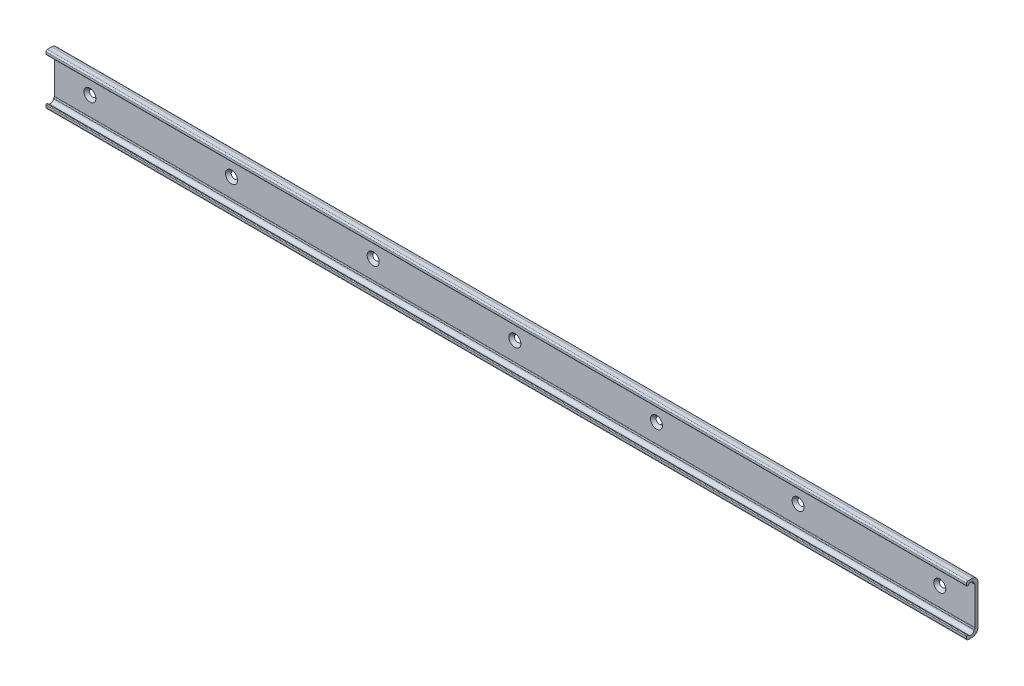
ISO-10303-21;
HEADER;
FILE_DESCRIPTION(('STEP AP214'),'2;1');
FILE_NAME('part.step','',(''),(''),'','','');
FILE_SCHEMA(('AUTOMOTIVE_DESIGN { 1 0 10303 214 1 1 1 1 }'));
ENDSEC;
DATA;
#1=APPLICATION_CONTEXT('core data for automotive mechanical design processes');
#2=APPLICATION_PROTOCOL_DEFINITION('international standard','automotive_design',2000,#1);
#3=PRODUCT_CONTEXT('',#1,'mechanical');
#4=PRODUCT('Part','Part','',(#3));
#5=PRODUCT_RELATED_PRODUCT_CATEGORY('part','',(#4));
#6=PRODUCT_DEFINITION_FORMATION('','',#4);
#7=PRODUCT_DEFINITION_CONTEXT('part definition',#1,'design');
#8=PRODUCT_DEFINITION('design','',#6,#7);
#9=PRODUCT_DEFINITION_SHAPE('','',#8);
#10=(LENGTH_UNIT() NAMED_UNIT(*) SI_UNIT(.MILLI.,.METRE.));
#11=(NAMED_UNIT(*) PLANE_ANGLE_UNIT() SI_UNIT($,.RADIAN.));
#12=(NAMED_UNIT(*) SI_UNIT($,.STERADIAN.) SOLID_ANGLE_UNIT());
#13=UNCERTAINTY_MEASURE_WITH_UNIT(LENGTH_MEASURE(1.E-05),#10,'distance_accuracy_value','');
#14=(GEOMETRIC_REPRESENTATION_CONTEXT(3) GLOBAL_UNCERTAINTY_ASSIGNED_CONTEXT((#13)) GLOBAL_UNIT_ASSIGNED_CONTEXT((#10,
#11,#12)) REPRESENTATION_CONTEXT('',''));
#15=CARTESIAN_POINT('',(0.,0.,0.));
#16=DIRECTION('',(0.,0.,1.));
#17=DIRECTION('',(1.,0.,0.));
#18=AXIS2_PLACEMENT_3D('',#15,#16,#17);
#19=CARTESIAN_POINT('',(625.,14.,4.));
#20=DIRECTION('',(-1.,0.,0.));
#21=DIRECTION('',(0.,0.,1.));
#22=AXIS2_PLACEMENT_3D('',#19,#20,#21);
#23=CYLINDRICAL_SURFACE('',#22,4.);
#24=CARTESIAN_POINT('',(-25.,14.,4.));
#25=DIRECTION('',(-1.,0.,0.));
#26=DIRECTION('',(0.,0.,1.));
#27=AXIS2_PLACEMENT_3D('',#24,#25,#26);
#28=CIRCLE('',#27,4.);
#29=CARTESIAN_POINT('',(-25.,18.,4.));
#30=VERTEX_POINT('',#29);
#31=CARTESIAN_POINT('',(-25.,14.,0.));
#32=VERTEX_POINT('',#31);
#33=EDGE_CURVE('E174',#30,#32,#28,.T.);
#34=ORIENTED_EDGE('',*,*,#33,.F.);
#35=DIRECTION('',(-1.,0.,0.));
#36=VECTOR('',#35,1.);
#37=CARTESIAN_POINT('',(625.,18.,4.));
#38=LINE('',#37,#36);
#39=CARTESIAN_POINT('',(625.,18.,4.));
#40=VERTEX_POINT('',#39);
#41=EDGE_CURVE('E9',#40,#30,#38,.T.);
#42=ORIENTED_EDGE('',*,*,#41,.F.);
#43=CARTESIAN_POINT('',(625.,14.,4.));
#44=DIRECTION('',(-1.,0.,0.));
#45=DIRECTION('',(0.,0.,1.));
#46=AXIS2_PLACEMENT_3D('',#43,#44,#45);
#47=CIRCLE('',#46,4.);
#48=CARTESIAN_POINT('',(625.,14.,0.));
#49=VERTEX_POINT('',#48);
#50=EDGE_CURVE('E176',#40,#49,#47,.T.);
#51=ORIENTED_EDGE('',*,*,#50,.T.);
#52=DIRECTION('',(-1.,0.,0.));
#53=VECTOR('',#52,1.);
#54=CARTESIAN_POINT('',(625.,14.,0.));
#55=LINE('',#54,#53);
#56=EDGE_CURVE('E17',#49,#32,#55,.T.);
#57=ORIENTED_EDGE('',*,*,#56,.T.);
#58=EDGE_LOOP('',(#34,#42,#51,#57));
#59=FACE_BOUND('',#58,.T.);
#60=ADVANCED_FACE('F14',(#59),#23,.T.);
#61=CARTESIAN_POINT('',(625.,18.,7.));
#62=DIRECTION('',(0.,1.,0.));
#63=DIRECTION('',(-1.,0.,0.));
#64=AXIS2_PLACEMENT_3D('',#61,#62,#63);
#65=PLANE('',#64);
#66=DIRECTION('',(0.,0.,-1.));
#67=VECTOR('',#66,1.);
#68=CARTESIAN_POINT('',(-25.,18.,7.));
#69=LINE('',#68,#67);
#70=CARTESIAN_POINT('',(-25.,18.,7.));
#71=VERTEX_POINT('',#70);
#72=EDGE_CURVE('E192',#71,#30,#69,.T.);
#73=ORIENTED_EDGE('',*,*,#72,.F.);
#74=DIRECTION('',(-1.,0.,0.));
#75=VECTOR('',#74,1.);
#76=CARTESIAN_POINT('',(625.,18.,7.));
#77=LINE('',#76,#75);
#78=CARTESIAN_POINT('',(625.,18.,7.));
#79=VERTEX_POINT('',#78);
#80=EDGE_CURVE('E22',#79,#71,#77,.T.);
#81=ORIENTED_EDGE('',*,*,#80,.F.);
#82=DIRECTION('',(0.,0.,-1.));
#83=VECTOR('',#82,1.);
#84=CARTESIAN_POINT('',(625.,18.,7.));
#85=LINE('',#84,#83);
#86=EDGE_CURVE('E181',#79,#40,#85,.T.);
#87=ORIENTED_EDGE('',*,*,#86,.T.);
#88=ORIENTED_EDGE('',*,*,#41,.T.);
#89=EDGE_LOOP('',(#73,#81,#87,#88));
#90=FACE_BOUND('',#89,.T.);
#91=ADVANCED_FACE('F448',(#90),#65,.T.);
#92=CARTESIAN_POINT('',(625.,17.,7.));
#93=DIRECTION('',(-1.,0.,0.));
#94=DIRECTION('',(0.,0.,1.));
#95=AXIS2_PLACEMENT_3D('',#92,#93,#94);
#96=CYLINDRICAL_SURFACE('',#95,1.);
#97=CARTESIAN_POINT('',(-25.,17.,7.));
#98=DIRECTION('',(-1.,0.,0.));
#99=DIRECTION('',(0.,0.,1.));
#100=AXIS2_PLACEMENT_3D('',#97,#98,#99);
#101=CIRCLE('',#100,1.);
#102=CARTESIAN_POINT('',(-25.,17.,8.));
#103=VERTEX_POINT('',#102);
#104=EDGE_CURVE('E258',#103,#71,#101,.T.);
#105=ORIENTED_EDGE('',*,*,#104,.F.);
#106=DIRECTION('',(-1.,0.,0.));
#107=VECTOR('',#106,1.);
#108=CARTESIAN_POINT('',(625.,17.,8.));
#109=LINE('',#108,#107);
#110=CARTESIAN_POINT('',(625.,17.,8.));
#111=VERTEX_POINT('',#110);
#112=EDGE_CURVE('E328',#111,#103,#109,.T.);
#113=ORIENTED_EDGE('',*,*,#112,.F.);
#114=CARTESIAN_POINT('',(625.,17.,7.));
#115=DIRECTION('',(-1.,0.,0.));
#116=DIRECTION('',(0.,0.,1.));
#117=AXIS2_PLACEMENT_3D('',#114,#115,#116);
#118=CIRCLE('',#117,1.);
#119=EDGE_CURVE('E324',#111,#79,#118,.T.);
#120=ORIENTED_EDGE('',*,*,#119,.T.);
#121=ORIENTED_EDGE('',*,*,#80,.T.);
#122=EDGE_LOOP('',(#105,#113,#120,#121));
#123=FACE_BOUND('',#122,.T.);
#124=ADVANCED_FACE('F453',(#123),#96,.T.);
#125=CARTESIAN_POINT('',(625.,15.55,8.));
#126=DIRECTION('',(0.,0.,1.));
#127=DIRECTION('',(1.,0.,0.));
#128=AXIS2_PLACEMENT_3D('',#125,#126,#127);
#129=PLANE('',#128);
#130=DIRECTION('',(0.,1.,0.));
#131=VECTOR('',#130,1.);
#132=CARTESIAN_POINT('',(-25.,15.55,8.));
#133=LINE('',#132,#131);
#134=CARTESIAN_POINT('',(-25.,15.55,8.));
#135=VERTEX_POINT('',#134);
#136=EDGE_CURVE('E255',#135,#103,#133,.T.);
#137=ORIENTED_EDGE('',*,*,#136,.F.);
#138=DIRECTION('',(-1.,0.,0.));
#139=VECTOR('',#138,1.);
#140=CARTESIAN_POINT('',(625.,15.55,8.));
#141=LINE('',#140,#139);
#142=CARTESIAN_POINT('',(625.,15.55,8.));
#143=VERTEX_POINT('',#142);
#144=EDGE_CURVE('E330',#143,#135,#141,.T.);
#145=ORIENTED_EDGE('',*,*,#144,.F.);
#146=DIRECTION('',(0.,1.,0.));
#147=VECTOR('',#146,1.);
#148=CARTESIAN_POINT('',(625.,15.55,8.));
#149=LINE('',#148,#147);
#150=EDGE_CURVE('E321',#143,#111,#149,.T.);
#151=ORIENTED_EDGE('',*,*,#150,.T.);
#152=ORIENTED_EDGE('',*,*,#112,.T.);
#153=EDGE_LOOP('',(#137,#145,#151,#152));
#154=FACE_BOUND('',#153,.T.);
#155=ADVANCED_FACE('F445',(#154),#129,.T.);
#156=CARTESIAN_POINT('',(625.,15.5499998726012,7.5));
#157=DIRECTION('',(-1.,0.,0.));
#158=DIRECTION('',(0.,0.,1.));
#159=AXIS2_PLACEMENT_3D('',#156,#157,#158);
#160=CYLINDRICAL_SURFACE('',#159,0.500000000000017);
#161=CARTESIAN_POINT('',(-25.,15.5499998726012,7.5));
#162=DIRECTION('',(-1.,0.,0.));
#163=DIRECTION('',(0.,0.,1.));
#164=AXIS2_PLACEMENT_3D('',#161,#162,#163);
#165=CIRCLE('',#164,0.500000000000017);
#166=CARTESIAN_POINT('',(-25.,15.0499998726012,7.49999995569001));
#167=VERTEX_POINT('',#166);
#168=EDGE_CURVE('E252',#167,#135,#165,.T.);
#169=ORIENTED_EDGE('',*,*,#168,.F.);
#170=DIRECTION('',(-1.,0.,0.));
#171=VECTOR('',#170,1.);
#172=CARTESIAN_POINT('',(625.,15.0499998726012,7.49999995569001));
#173=LINE('',#172,#171);
#174=CARTESIAN_POINT('',(625.,15.0499998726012,7.49999995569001));
#175=VERTEX_POINT('',#174);
#176=EDGE_CURVE('E332',#175,#167,#173,.T.);
#177=ORIENTED_EDGE('',*,*,#176,.F.);
#178=CARTESIAN_POINT('',(625.,15.5499998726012,7.5));
#179=DIRECTION('',(-1.,0.,0.));
#180=DIRECTION('',(0.,0.,1.));
#181=AXIS2_PLACEMENT_3D('',#178,#179,#180);
#182=CIRCLE('',#181,0.500000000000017);
#183=EDGE_CURVE('E318',#175,#143,#182,.T.);
#184=ORIENTED_EDGE('',*,*,#183,.T.);
#185=ORIENTED_EDGE('',*,*,#144,.T.);
#186=EDGE_LOOP('',(#169,#177,#184,#185));
#187=FACE_BOUND('',#186,.T.);
#188=ADVANCED_FACE('F441',(#187),#160,.T.);
#189=CARTESIAN_POINT('',(625.,15.0499998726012,7.49999995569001));
#190=DIRECTION('',(0.,-1.,0.));
#191=DIRECTION('',(1.,0.,0.));
#192=AXIS2_PLACEMENT_3D('',#189,#190,#191);
#193=PLANE('',#192);
#194=DIRECTION('',(0.,0.,1.));
#195=VECTOR('',#194,1.);
#196=CARTESIAN_POINT('',(-25.,15.0499998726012,7.49999995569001));
#197=LINE('',#196,#195);
#198=CARTESIAN_POINT('',(-25.,15.0499998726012,6.99185845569));
#199=VERTEX_POINT('',#198);
#200=EDGE_CURVE('E249',#199,#167,#197,.T.);
#201=ORIENTED_EDGE('',*,*,#200,.F.);
#202=DIRECTION('',(-1.,0.,0.));
#203=VECTOR('',#202,1.);
#204=CARTESIAN_POINT('',(625.,15.0499998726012,6.99185845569));
#205=LINE('',#204,#203);
#206=CARTESIAN_POINT('',(625.,15.0499998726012,6.99185845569));
#207=VERTEX_POINT('',#206);
#208=EDGE_CURVE('E334',#207,#199,#205,.T.);
#209=ORIENTED_EDGE('',*,*,#208,.F.);
#210=DIRECTION('',(0.,0.,1.));
#211=VECTOR('',#210,1.);
#212=CARTESIAN_POINT('',(625.,15.0499998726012,7.49999995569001));
#213=LINE('',#212,#211);
#214=EDGE_CURVE('E315',#207,#175,#213,.T.);
#215=ORIENTED_EDGE('',*,*,#214,.T.);
#216=ORIENTED_EDGE('',*,*,#176,.T.);
#217=EDGE_LOOP('',(#201,#209,#215,#216));
#218=FACE_BOUND('',#217,.T.);
#219=ADVANCED_FACE('F437',(#218),#193,.T.);
#220=CARTESIAN_POINT('',(625.,13.899999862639,4.99999993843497));
#221=DIRECTION('',(-1.,0.,0.));
#222=DIRECTION('',(0.,0.,1.));
#223=AXIS2_PLACEMENT_3D('',#220,#221,#222);
#224=CYLINDRICAL_SURFACE('',#223,2.30000008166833);
#225=CARTESIAN_POINT('',(-25.,13.899999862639,4.99999993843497));
#226=DIRECTION('',(1.,0.,0.));
#227=DIRECTION('',(0.,0.,1.));
#228=AXIS2_PLACEMENT_3D('',#225,#226,#227);
#229=CIRCLE('',#228,2.30000008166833);
#230=CARTESIAN_POINT('',(-25.,14.3822673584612,2.75112945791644));
#231=VERTEX_POINT('',#230);
#232=EDGE_CURVE('E246',#231,#199,#229,.T.);
#233=ORIENTED_EDGE('',*,*,#232,.F.);
#234=DIRECTION('',(-1.,0.,0.));
#235=VECTOR('',#234,1.);
#236=CARTESIAN_POINT('',(625.,14.3822673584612,2.75112945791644));
#237=LINE('',#236,#235);
#238=CARTESIAN_POINT('',(625.,14.3822673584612,2.75112945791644));
#239=VERTEX_POINT('',#238);
#240=EDGE_CURVE('E336',#239,#231,#237,.T.);
#241=ORIENTED_EDGE('',*,*,#240,.F.);
#242=CARTESIAN_POINT('',(625.,13.899999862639,4.99999993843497));
#243=DIRECTION('',(1.,0.,0.));
#244=DIRECTION('',(0.,0.,1.));
#245=AXIS2_PLACEMENT_3D('',#242,#243,#244);
#246=CIRCLE('',#245,2.30000008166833);
#247=EDGE_CURVE('E312',#239,#207,#246,.T.);
#248=ORIENTED_EDGE('',*,*,#247,.T.);
#249=ORIENTED_EDGE('',*,*,#208,.T.);
#250=EDGE_LOOP('',(#233,#241,#248,#249));
#251=FACE_BOUND('',#250,.T.);
#252=ADVANCED_FACE('F433',(#251),#224,.F.);
#253=CARTESIAN_POINT('',(625.,14.2647621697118,2.72240648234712));
#254=DIRECTION('',(0.,-0.237449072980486,0.971399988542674));
#255=DIRECTION('',(0.,0.971399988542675,0.237449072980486));
#256=AXIS2_PLACEMENT_3D('',#253,#254,#255);
#257=PLANE('',#256);
#258=DIRECTION('',(0.,0.971399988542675,0.237449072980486));
#259=VECTOR('',#258,1.);
#260=CARTESIAN_POINT('',(-25.,14.2647621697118,2.72240648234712));
#261=LINE('',#260,#259);
#262=CARTESIAN_POINT('',(-25.,14.2647621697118,2.72240648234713));
#263=VERTEX_POINT('',#262);
#264=EDGE_CURVE('E243',#263,#231,#261,.T.);
#265=ORIENTED_EDGE('',*,*,#264,.F.);
#266=DIRECTION('',(-1.,0.,0.));
#267=VECTOR('',#266,1.);
#268=CARTESIAN_POINT('',(625.,14.2647621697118,2.72240648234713));
#269=LINE('',#268,#267);
#270=CARTESIAN_POINT('',(625.,14.2647621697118,2.72240648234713));
#271=VERTEX_POINT('',#270);
#272=EDGE_CURVE('E338',#271,#263,#269,.T.);
#273=ORIENTED_EDGE('',*,*,#272,.F.);
#274=DIRECTION('',(0.,0.971399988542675,0.237449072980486));
#275=VECTOR('',#274,1.);
#276=CARTESIAN_POINT('',(625.,14.2647621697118,2.72240648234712));
#277=LINE('',#276,#275);
#278=EDGE_CURVE('E309',#271,#239,#277,.T.);
#279=ORIENTED_EDGE('',*,*,#278,.T.);
#280=ORIENTED_EDGE('',*,*,#240,.T.);
#281=EDGE_LOOP('',(#265,#273,#279,#280));
#282=FACE_BOUND('',#281,.T.);
#283=ADVANCED_FACE('F429',(#282),#257,.T.);
#284=CARTESIAN_POINT('',(625.,14.3343843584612,2.2272774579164));
#285=DIRECTION('',(-1.,0.,0.));
#286=DIRECTION('',(0.,0.,1.));
#287=AXIS2_PLACEMENT_3D('',#284,#285,#286);
#288=CYLINDRICAL_SURFACE('',#287,0.49999999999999);
#289=CARTESIAN_POINT('',(-25.,14.3343843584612,2.2272774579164));
#290=DIRECTION('',(-1.,0.,0.));
#291=DIRECTION('',(0.,0.,1.));
#292=AXIS2_PLACEMENT_3D('',#289,#290,#291);
#293=CIRCLE('',#292,0.49999999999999);
#294=CARTESIAN_POINT('',(-25.,13.980830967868,2.58083084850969));
#295=VERTEX_POINT('',#294);
#296=EDGE_CURVE('E240',#295,#263,#293,.T.);
#297=ORIENTED_EDGE('',*,*,#296,.F.);
#298=DIRECTION('',(-1.,0.,0.));
#299=VECTOR('',#298,1.);
#300=CARTESIAN_POINT('',(625.,13.980830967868,2.58083084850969));
#301=LINE('',#300,#299);
#302=CARTESIAN_POINT('',(625.,13.980830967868,2.58083084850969));
#303=VERTEX_POINT('',#302);
#304=EDGE_CURVE('E340',#303,#295,#301,.T.);
#305=ORIENTED_EDGE('',*,*,#304,.F.);
#306=CARTESIAN_POINT('',(625.,14.3343843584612,2.2272774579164));
#307=DIRECTION('',(-1.,0.,0.));
#308=DIRECTION('',(0.,0.,1.));
#309=AXIS2_PLACEMENT_3D('',#306,#307,#308);
#310=CIRCLE('',#309,0.49999999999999);
#311=EDGE_CURVE('E306',#303,#271,#310,.T.);
#312=ORIENTED_EDGE('',*,*,#311,.T.);
#313=ORIENTED_EDGE('',*,*,#272,.T.);
#314=EDGE_LOOP('',(#297,#305,#312,#313));
#315=FACE_BOUND('',#314,.T.);
#316=ADVANCED_FACE('F425',(#315),#288,.T.);
#317=CARTESIAN_POINT('',(625.,13.5464468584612,2.1464464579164));
#318=DIRECTION('',(0.,-0.707107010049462,0.707106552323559));
#319=DIRECTION('',(0.,0.707106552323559,0.707107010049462));
#320=AXIS2_PLACEMENT_3D('',#317,#318,#319);
#321=PLANE('',#320);
#322=DIRECTION('',(0.,0.707106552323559,0.707107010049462));
#323=VECTOR('',#322,1.);
#324=CARTESIAN_POINT('',(-25.,13.5464468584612,2.1464464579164));
#325=LINE('',#324,#323);
#326=CARTESIAN_POINT('',(-25.,13.5464468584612,2.1464464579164));
#327=VERTEX_POINT('',#326);
#328=EDGE_CURVE('E237',#327,#295,#325,.T.);
#329=ORIENTED_EDGE('',*,*,#328,.F.);
#330=DIRECTION('',(-1.,0.,0.));
#331=VECTOR('',#330,1.);
#332=CARTESIAN_POINT('',(625.,13.5464468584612,2.1464464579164));
#333=LINE('',#332,#331);
#334=CARTESIAN_POINT('',(625.,13.5464468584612,2.1464464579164));
#335=VERTEX_POINT('',#334);
#336=EDGE_CURVE('E342',#335,#327,#333,.T.);
#337=ORIENTED_EDGE('',*,*,#336,.F.);
#338=DIRECTION('',(0.,0.707106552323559,0.707107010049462));
#339=VECTOR('',#338,1.);
#340=CARTESIAN_POINT('',(625.,13.5464468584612,2.1464464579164));
#341=LINE('',#340,#339);
#342=EDGE_CURVE('E303',#335,#303,#341,.T.);
#343=ORIENTED_EDGE('',*,*,#342,.T.);
#344=ORIENTED_EDGE('',*,*,#304,.T.);
#345=EDGE_LOOP('',(#329,#337,#343,#344));
#346=FACE_BOUND('',#345,.T.);
#347=ADVANCED_FACE('F421',(#346),#321,.T.);
#348=CARTESIAN_POINT('',(625.,13.1928934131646,2.49999990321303));
#349=DIRECTION('',(-1.,0.,0.));
#350=DIRECTION('',(0.,0.,1.));
#351=AXIS2_PLACEMENT_3D('',#348,#349,#350);
#352=CYLINDRICAL_SURFACE('',#351,0.500000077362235);
#353=CARTESIAN_POINT('',(-25.,13.1928934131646,2.49999990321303));
#354=DIRECTION('',(1.,0.,0.));
#355=DIRECTION('',(0.,0.,1.));
#356=AXIS2_PLACEMENT_3D('',#353,#354,#355);
#357=CIRCLE('',#356,0.500000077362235);
#358=CARTESIAN_POINT('',(-25.,13.1928934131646,1.9999998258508));
#359=VERTEX_POINT('',#358);
#360=EDGE_CURVE('E234',#359,#327,#357,.T.);
#361=ORIENTED_EDGE('',*,*,#360,.F.);
#362=DIRECTION('',(-1.,0.,0.));
#363=VECTOR('',#362,1.);
#364=CARTESIAN_POINT('',(625.,13.1928934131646,1.9999998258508));
#365=LINE('',#364,#363);
#366=CARTESIAN_POINT('',(625.,13.1928934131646,1.9999998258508));
#367=VERTEX_POINT('',#366);
#368=EDGE_CURVE('E344',#367,#359,#365,.T.);
#369=ORIENTED_EDGE('',*,*,#368,.F.);
#370=CARTESIAN_POINT('',(625.,13.1928934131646,2.49999990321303));
#371=DIRECTION('',(1.,0.,0.));
#372=DIRECTION('',(0.,0.,1.));
#373=AXIS2_PLACEMENT_3D('',#370,#371,#372);
#374=CIRCLE('',#373,0.500000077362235);
#375=EDGE_CURVE('E300',#367,#335,#374,.T.);
#376=ORIENTED_EDGE('',*,*,#375,.T.);
#377=ORIENTED_EDGE('',*,*,#336,.T.);
#378=EDGE_LOOP('',(#361,#369,#376,#377));
#379=FACE_BOUND('',#378,.T.);
#380=ADVANCED_FACE('F417',(#379),#352,.F.);
#381=CARTESIAN_POINT('',(625.,-13.1928934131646,1.9999998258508));
#382=DIRECTION('',(0.,0.,1.));
#383=DIRECTION('',(0.,1.,0.));
#384=AXIS2_PLACEMENT_3D('',#381,#382,#383);
#385=PLANE('',#384);
#386=CARTESIAN_POINT('',(600.,0.,1.9999998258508));
#387=DIRECTION('',(0.,0.,1.));
#388=DIRECTION('',(0.,1.,0.));
#389=AXIS2_PLACEMENT_3D('',#386,#387,#388);
#390=CIRCLE('',#389,4.25);
#391=CARTESIAN_POINT('',(600.,4.25,1.99999982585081));
#392=VERTEX_POINT('',#391);
#393=EDGE_CURVE('E742',#392,#392,#390,.T.);
#394=ORIENTED_EDGE('',*,*,#393,.F.);
#395=EDGE_LOOP('',(#394));
#396=FACE_BOUND('',#395,.T.);
#397=CARTESIAN_POINT('',(500.,0.,1.9999998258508));
#398=DIRECTION('',(0.,0.,1.));
#399=DIRECTION('',(0.,1.,0.));
#400=AXIS2_PLACEMENT_3D('',#397,#398,#399);
#401=CIRCLE('',#400,4.25);
#402=CARTESIAN_POINT('',(500.,4.25,1.99999982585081));
#403=VERTEX_POINT('',#402);
#404=EDGE_CURVE('E746',#403,#403,#401,.T.);
#405=ORIENTED_EDGE('',*,*,#404,.F.);
#406=EDGE_LOOP('',(#405));
#407=FACE_BOUND('',#406,.T.);
#408=CARTESIAN_POINT('',(400.,0.,1.9999998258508));
#409=DIRECTION('',(0.,0.,1.));
#410=DIRECTION('',(0.,1.,0.));
#411=AXIS2_PLACEMENT_3D('',#408,#409,#410);
#412=CIRCLE('',#411,4.25);
#413=CARTESIAN_POINT('',(400.,4.25,1.99999982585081));
#414=VERTEX_POINT('',#413);
#415=EDGE_CURVE('E755',#414,#414,#412,.T.);
#416=ORIENTED_EDGE('',*,*,#415,.F.);
#417=EDGE_LOOP('',(#416));
#418=FACE_BOUND('',#417,.T.);
#419=CARTESIAN_POINT('',(300.,0.,1.9999998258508));
#420=DIRECTION('',(0.,0.,1.));
#421=DIRECTION('',(0.,1.,0.));
#422=AXIS2_PLACEMENT_3D('',#419,#420,#421);
#423=CIRCLE('',#422,4.25);
#424=CARTESIAN_POINT('',(300.,4.25,1.99999982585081));
#425=VERTEX_POINT('',#424);
#426=EDGE_CURVE('E761',#425,#425,#423,.T.);
#427=ORIENTED_EDGE('',*,*,#426,.F.);
#428=EDGE_LOOP('',(#427));
#429=FACE_BOUND('',#428,.T.);
#430=CARTESIAN_POINT('',(200.,0.,1.9999998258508));
#431=DIRECTION('',(0.,0.,1.));
#432=DIRECTION('',(0.,1.,0.));
#433=AXIS2_PLACEMENT_3D('',#430,#431,#432);
#434=CIRCLE('',#433,4.25);
#435=CARTESIAN_POINT('',(200.,4.25,1.99999982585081));
#436=VERTEX_POINT('',#435);
#437=EDGE_CURVE('E767',#436,#436,#434,.T.);
#438=ORIENTED_EDGE('',*,*,#437,.F.);
#439=EDGE_LOOP('',(#438));
#440=FACE_BOUND('',#439,.T.);
#441=CARTESIAN_POINT('',(100.,0.,1.9999998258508));
#442=DIRECTION('',(0.,0.,1.));
#443=DIRECTION('',(0.,1.,0.));
#444=AXIS2_PLACEMENT_3D('',#441,#442,#443);
#445=CIRCLE('',#444,4.25);
#446=CARTESIAN_POINT('',(100.,4.25,1.99999982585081));
#447=VERTEX_POINT('',#446);
#448=EDGE_CURVE('E773',#447,#447,#445,.T.);
#449=ORIENTED_EDGE('',*,*,#448,.F.);
#450=EDGE_LOOP('',(#449));
#451=FACE_BOUND('',#450,.T.);
#452=CARTESIAN_POINT('',(0.,0.,1.9999998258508));
#453=DIRECTION('',(0.,0.,1.));
#454=DIRECTION('',(0.,1.,0.));
#455=AXIS2_PLACEMENT_3D('',#452,#453,#454);
#456=CIRCLE('',#455,4.25);
#457=CARTESIAN_POINT('',(0.,4.25,1.99999982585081));
#458=VERTEX_POINT('',#457);
#459=EDGE_CURVE('E196',#458,#458,#456,.T.);
#460=ORIENTED_EDGE('',*,*,#459,.F.);
#461=EDGE_LOOP('',(#460));
#462=FACE_BOUND('',#461,.T.);
#463=DIRECTION('',(0.,1.,0.));
#464=VECTOR('',#463,1.);
#465=CARTESIAN_POINT('',(-25.,-13.1928934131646,1.9999998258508));
#466=LINE('',#465,#464);
#467=CARTESIAN_POINT('',(-25.,-13.1928934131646,1.9999998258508));
#468=VERTEX_POINT('',#467);
#469=EDGE_CURVE('E231',#468,#359,#466,.T.);
#470=ORIENTED_EDGE('',*,*,#469,.F.);
#471=DIRECTION('',(-1.,0.,0.));
#472=VECTOR('',#471,1.);
#473=CARTESIAN_POINT('',(625.,-13.1928934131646,1.9999998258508));
#474=LINE('',#473,#472);
#475=CARTESIAN_POINT('',(625.,-13.1928934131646,1.9999998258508));
#476=VERTEX_POINT('',#475);
#477=EDGE_CURVE('E346',#476,#468,#474,.T.);
#478=ORIENTED_EDGE('',*,*,#477,.F.);
#479=DIRECTION('',(0.,1.,0.));
#480=VECTOR('',#479,1.);
#481=CARTESIAN_POINT('',(625.,-13.1928934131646,1.9999998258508));
#482=LINE('',#481,#480);
#483=EDGE_CURVE('E297',#476,#367,#482,.T.);
#484=ORIENTED_EDGE('',*,*,#483,.T.);
#485=ORIENTED_EDGE('',*,*,#368,.T.);
#486=EDGE_LOOP('',(#470,#478,#484,#485));
#487=FACE_BOUND('',#486,.T.);
#488=ADVANCED_FACE('F413',(#396,#407,#418,#429,#440,#451,#462,#487),#385,.T.);
#489=CARTESIAN_POINT('',(625.,-13.1928934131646,2.49999990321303));
#490=DIRECTION('',(-1.,0.,0.));
#491=DIRECTION('',(0.,0.,1.));
#492=AXIS2_PLACEMENT_3D('',#489,#490,#491);
#493=CYLINDRICAL_SURFACE('',#492,0.500000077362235);
#494=CARTESIAN_POINT('',(-25.,-13.1928934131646,2.49999990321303));
#495=DIRECTION('',(1.,0.,0.));
#496=DIRECTION('',(0.,0.,-1.));
#497=AXIS2_PLACEMENT_3D('',#494,#495,#496);
#498=CIRCLE('',#497,0.500000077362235);
#499=CARTESIAN_POINT('',(-25.,-13.5464468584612,2.1464464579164));
#500=VERTEX_POINT('',#499);
#501=EDGE_CURVE('E228',#500,#468,#498,.T.);
#502=ORIENTED_EDGE('',*,*,#501,.F.);
#503=DIRECTION('',(-1.,0.,0.));
#504=VECTOR('',#503,1.);
#505=CARTESIAN_POINT('',(625.,-13.5464468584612,2.1464464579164));
#506=LINE('',#505,#504);
#507=CARTESIAN_POINT('',(625.,-13.5464468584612,2.1464464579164));
#508=VERTEX_POINT('',#507);
#509=EDGE_CURVE('E348',#508,#500,#506,.T.);
#510=ORIENTED_EDGE('',*,*,#509,.F.);
#511=CARTESIAN_POINT('',(625.,-13.1928934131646,2.49999990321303));
#512=DIRECTION('',(1.,0.,0.));
#513=DIRECTION('',(0.,0.,-1.));
#514=AXIS2_PLACEMENT_3D('',#511,#512,#513);
#515=CIRCLE('',#514,0.500000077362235);
#516=EDGE_CURVE('E294',#508,#476,#515,.T.);
#517=ORIENTED_EDGE('',*,*,#516,.T.);
#518=ORIENTED_EDGE('',*,*,#477,.T.);
#519=EDGE_LOOP('',(#502,#510,#517,#518));
#520=FACE_BOUND('',#519,.T.);
#521=ADVANCED_FACE('F409',(#520),#493,.F.);
#522=CARTESIAN_POINT('',(625.,-13.5464468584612,2.1464464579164));
#523=DIRECTION('',(0.,0.707107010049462,0.707106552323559));
#524=DIRECTION('',(0.,0.707106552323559,-0.707107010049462));
#525=AXIS2_PLACEMENT_3D('',#522,#523,#524);
#526=PLANE('',#525);
#527=DIRECTION('',(0.,0.707106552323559,-0.707107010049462));
#528=VECTOR('',#527,1.);
#529=CARTESIAN_POINT('',(-25.,-13.5464468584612,2.1464464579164));
#530=LINE('',#529,#528);
#531=CARTESIAN_POINT('',(-25.,-13.980830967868,2.58083084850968));
#532=VERTEX_POINT('',#531);
#533=EDGE_CURVE('E225',#532,#500,#530,.T.);
#534=ORIENTED_EDGE('',*,*,#533,.F.);
#535=DIRECTION('',(-1.,0.,0.));
#536=VECTOR('',#535,1.);
#537=CARTESIAN_POINT('',(625.,-13.980830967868,2.58083084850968));
#538=LINE('',#537,#536);
#539=CARTESIAN_POINT('',(625.,-13.980830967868,2.58083084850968));
#540=VERTEX_POINT('',#539);
#541=EDGE_CURVE('E350',#540,#532,#538,.T.);
#542=ORIENTED_EDGE('',*,*,#541,.F.);
#543=DIRECTION('',(0.,0.707106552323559,-0.707107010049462));
#544=VECTOR('',#543,1.);
#545=CARTESIAN_POINT('',(625.,-13.5464468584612,2.1464464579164));
#546=LINE('',#545,#544);
#547=EDGE_CURVE('E291',#540,#508,#546,.T.);
#548=ORIENTED_EDGE('',*,*,#547,.T.);
#549=ORIENTED_EDGE('',*,*,#509,.T.);
#550=EDGE_LOOP('',(#534,#542,#548,#549));
#551=FACE_BOUND('',#550,.T.);
#552=ADVANCED_FACE('F405',(#551),#526,.T.);
#553=CARTESIAN_POINT('',(625.,-14.3343843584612,2.22727745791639));
#554=DIRECTION('',(-1.,0.,0.));
#555=DIRECTION('',(0.,0.,1.));
#556=AXIS2_PLACEMENT_3D('',#553,#554,#555);
#557=CYLINDRICAL_SURFACE('',#556,0.49999999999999);
#558=CARTESIAN_POINT('',(-25.,-14.3343843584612,2.22727745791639));
#559=DIRECTION('',(-1.,0.,0.));
#560=DIRECTION('',(0.,0.,-1.));
#561=AXIS2_PLACEMENT_3D('',#558,#559,#560);
#562=CIRCLE('',#561,0.49999999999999);
#563=CARTESIAN_POINT('',(-25.,-14.2647621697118,2.72240648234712));
#564=VERTEX_POINT('',#563);
#565=EDGE_CURVE('E222',#564,#532,#562,.T.);
#566=ORIENTED_EDGE('',*,*,#565,.F.);
#567=DIRECTION('',(-1.,0.,0.));
#568=VECTOR('',#567,1.);
#569=CARTESIAN_POINT('',(625.,-14.2647621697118,2.72240648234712));
#570=LINE('',#569,#568);
#571=CARTESIAN_POINT('',(625.,-14.2647621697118,2.72240648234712));
#572=VERTEX_POINT('',#571);
#573=EDGE_CURVE('E352',#572,#564,#570,.T.);
#574=ORIENTED_EDGE('',*,*,#573,.F.);
#575=CARTESIAN_POINT('',(625.,-14.3343843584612,2.22727745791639));
#576=DIRECTION('',(-1.,0.,0.));
#577=DIRECTION('',(0.,0.,-1.));
#578=AXIS2_PLACEMENT_3D('',#575,#576,#577);
#579=CIRCLE('',#578,0.49999999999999);
#580=EDGE_CURVE('E288',#572,#540,#579,.T.);
#581=ORIENTED_EDGE('',*,*,#580,.T.);
#582=ORIENTED_EDGE('',*,*,#541,.T.);
#583=EDGE_LOOP('',(#566,#574,#581,#582));
#584=FACE_BOUND('',#583,.T.);
#585=ADVANCED_FACE('F401',(#584),#557,.T.);
#586=CARTESIAN_POINT('',(625.,-14.2647621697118,2.72240648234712));
#587=DIRECTION('',(0.,0.237449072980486,0.971399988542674));
#588=DIRECTION('',(0.,0.971399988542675,-0.237449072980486));
#589=AXIS2_PLACEMENT_3D('',#586,#587,#588);
#590=PLANE('',#589);
#591=DIRECTION('',(0.,0.971399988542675,-0.237449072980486));
#592=VECTOR('',#591,1.);
#593=CARTESIAN_POINT('',(-25.,-14.2647621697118,2.72240648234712));
#594=LINE('',#593,#592);
#595=CARTESIAN_POINT('',(-25.,-14.3822673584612,2.75112945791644));
#596=VERTEX_POINT('',#595);
#597=EDGE_CURVE('E219',#596,#564,#594,.T.);
#598=ORIENTED_EDGE('',*,*,#597,.F.);
#599=DIRECTION('',(-1.,0.,0.));
#600=VECTOR('',#599,1.);
#601=CARTESIAN_POINT('',(625.,-14.3822673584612,2.75112945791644));
#602=LINE('',#601,#600);
#603=CARTESIAN_POINT('',(625.,-14.3822673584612,2.75112945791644));
#604=VERTEX_POINT('',#603);
#605=EDGE_CURVE('E354',#604,#596,#602,.T.);
#606=ORIENTED_EDGE('',*,*,#605,.F.);
#607=DIRECTION('',(0.,0.971399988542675,-0.237449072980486));
#608=VECTOR('',#607,1.);
#609=CARTESIAN_POINT('',(625.,-14.2647621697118,2.72240648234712));
#610=LINE('',#609,#608);
#611=EDGE_CURVE('E285',#604,#572,#610,.T.);
#612=ORIENTED_EDGE('',*,*,#611,.T.);
#613=ORIENTED_EDGE('',*,*,#573,.T.);
#614=EDGE_LOOP('',(#598,#606,#612,#613));
#615=FACE_BOUND('',#614,.T.);
#616=ADVANCED_FACE('F397',(#615),#590,.T.);
#617=CARTESIAN_POINT('',(625.,-13.899999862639,4.99999993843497));
#618=DIRECTION('',(-1.,0.,0.));
#619=DIRECTION('',(0.,0.,1.));
#620=AXIS2_PLACEMENT_3D('',#617,#618,#619);
#621=CYLINDRICAL_SURFACE('',#620,2.30000008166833);
#622=CARTESIAN_POINT('',(-25.,-13.899999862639,4.99999993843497));
#623=DIRECTION('',(1.,0.,0.));
#624=DIRECTION('',(0.,0.,-1.));
#625=AXIS2_PLACEMENT_3D('',#622,#623,#624);
#626=CIRCLE('',#625,2.30000008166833);
#627=CARTESIAN_POINT('',(-25.,-15.0499998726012,6.99185845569));
#628=VERTEX_POINT('',#627);
#629=EDGE_CURVE('E216',#628,#596,#626,.T.);
#630=ORIENTED_EDGE('',*,*,#629,.F.);
#631=DIRECTION('',(-1.,0.,0.));
#632=VECTOR('',#631,1.);
#633=CARTESIAN_POINT('',(625.,-15.0499998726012,6.99185845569));
#634=LINE('',#633,#632);
#635=CARTESIAN_POINT('',(625.,-15.0499998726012,6.99185845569));
#636=VERTEX_POINT('',#635);
#637=EDGE_CURVE('E356',#636,#628,#634,.T.);
#638=ORIENTED_EDGE('',*,*,#637,.F.);
#639=CARTESIAN_POINT('',(625.,-13.899999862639,4.99999993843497));
#640=DIRECTION('',(1.,0.,0.));
#641=DIRECTION('',(0.,0.,-1.));
#642=AXIS2_PLACEMENT_3D('',#639,#640,#641);
#643=CIRCLE('',#642,2.30000008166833);
#644=EDGE_CURVE('E282',#636,#604,#643,.T.);
#645=ORIENTED_EDGE('',*,*,#644,.T.);
#646=ORIENTED_EDGE('',*,*,#605,.T.);
#647=EDGE_LOOP('',(#630,#638,#645,#646));
#648=FACE_BOUND('',#647,.T.);
#649=ADVANCED_FACE('F393',(#648),#621,.F.);
#650=CARTESIAN_POINT('',(625.,-15.0499998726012,7.49999995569));
#651=DIRECTION('',(0.,1.,0.));
#652=DIRECTION('',(-1.,0.,0.));
#653=AXIS2_PLACEMENT_3D('',#650,#651,#652);
#654=PLANE('',#653);
#655=DIRECTION('',(0.,0.,-1.));
#656=VECTOR('',#655,1.);
#657=CARTESIAN_POINT('',(-25.,-15.0499998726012,7.49999995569));
#658=LINE('',#657,#656);
#659=CARTESIAN_POINT('',(-25.,-15.0499998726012,7.49999995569));
#660=VERTEX_POINT('',#659);
#661=EDGE_CURVE('E213',#660,#628,#658,.T.);
#662=ORIENTED_EDGE('',*,*,#661,.F.);
#663=DIRECTION('',(-1.,0.,0.));
#664=VECTOR('',#663,1.);
#665=CARTESIAN_POINT('',(625.,-15.0499998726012,7.49999995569));
#666=LINE('',#665,#664);
#667=CARTESIAN_POINT('',(625.,-15.0499998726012,7.49999995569));
#668=VERTEX_POINT('',#667);
#669=EDGE_CURVE('E358',#668,#660,#666,.T.);
#670=ORIENTED_EDGE('',*,*,#669,.F.);
#671=DIRECTION('',(0.,0.,-1.));
#672=VECTOR('',#671,1.);
#673=CARTESIAN_POINT('',(625.,-15.0499998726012,7.49999995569));
#674=LINE('',#673,#672);
#675=EDGE_CURVE('E279',#668,#636,#674,.T.);
#676=ORIENTED_EDGE('',*,*,#675,.T.);
#677=ORIENTED_EDGE('',*,*,#637,.T.);
#678=EDGE_LOOP('',(#662,#670,#676,#677));
#679=FACE_BOUND('',#678,.T.);
#680=ADVANCED_FACE('F389',(#679),#654,.T.);
#681=CARTESIAN_POINT('',(625.,-15.5499998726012,7.5));
#682=DIRECTION('',(-1.,0.,0.));
#683=DIRECTION('',(0.,0.,1.));
#684=AXIS2_PLACEMENT_3D('',#681,#682,#683);
#685=CYLINDRICAL_SURFACE('',#684,0.500000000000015);
#686=CARTESIAN_POINT('',(-25.,-15.5499998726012,7.5));
#687=DIRECTION('',(-1.,0.,0.));
#688=DIRECTION('',(0.,0.,-1.));
#689=AXIS2_PLACEMENT_3D('',#686,#687,#688);
#690=CIRCLE('',#689,0.500000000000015);
#691=CARTESIAN_POINT('',(-25.,-15.55,8.));
#692=VERTEX_POINT('',#691);
#693=EDGE_CURVE('E210',#692,#660,#690,.T.);
#694=ORIENTED_EDGE('',*,*,#693,.F.);
#695=DIRECTION('',(-1.,0.,0.));
#696=VECTOR('',#695,1.);
#697=CARTESIAN_POINT('',(625.,-15.55,8.));
#698=LINE('',#697,#696);
#699=CARTESIAN_POINT('',(625.,-15.55,8.));
#700=VERTEX_POINT('',#699);
#701=EDGE_CURVE('E360',#700,#692,#698,.T.);
#702=ORIENTED_EDGE('',*,*,#701,.F.);
#703=CARTESIAN_POINT('',(625.,-15.5499998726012,7.5));
#704=DIRECTION('',(-1.,0.,0.));
#705=DIRECTION('',(0.,0.,-1.));
#706=AXIS2_PLACEMENT_3D('',#703,#704,#705);
#707=CIRCLE('',#706,0.500000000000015);
#708=EDGE_CURVE('E276',#700,#668,#707,.T.);
#709=ORIENTED_EDGE('',*,*,#708,.T.);
#710=ORIENTED_EDGE('',*,*,#669,.T.);
#711=EDGE_LOOP('',(#694,#702,#709,#710));
#712=FACE_BOUND('',#711,.T.);
#713=ADVANCED_FACE('F385',(#712),#685,.T.);
#714=CARTESIAN_POINT('',(625.,-15.55,8.));
#715=DIRECTION('',(0.,0.,1.));
#716=DIRECTION('',(1.,0.,0.));
#717=AXIS2_PLACEMENT_3D('',#714,#715,#716);
#718=PLANE('',#717);
#719=DIRECTION('',(0.,1.,0.));
#720=VECTOR('',#719,1.);
#721=CARTESIAN_POINT('',(-25.,-15.55,8.));
#722=LINE('',#721,#720);
#723=CARTESIAN_POINT('',(-25.,-17.,8.));
#724=VERTEX_POINT('',#723);
#725=EDGE_CURVE('E207',#724,#692,#722,.T.);
#726=ORIENTED_EDGE('',*,*,#725,.F.);
#727=DIRECTION('',(-1.,0.,0.));
#728=VECTOR('',#727,1.);
#729=CARTESIAN_POINT('',(625.,-17.,8.));
#730=LINE('',#729,#728);
#731=CARTESIAN_POINT('',(625.,-17.,8.));
#732=VERTEX_POINT('',#731);
#733=EDGE_CURVE('E362',#732,#724,#730,.T.);
#734=ORIENTED_EDGE('',*,*,#733,.F.);
#735=DIRECTION('',(0.,1.,0.));
#736=VECTOR('',#735,1.);
#737=CARTESIAN_POINT('',(625.,-15.55,8.));
#738=LINE('',#737,#736);
#739=EDGE_CURVE('E273',#732,#700,#738,.T.);
#740=ORIENTED_EDGE('',*,*,#739,.T.);
#741=ORIENTED_EDGE('',*,*,#701,.T.);
#742=EDGE_LOOP('',(#726,#734,#740,#741));
#743=FACE_BOUND('',#742,.T.);
#744=ADVANCED_FACE('F381',(#743),#718,.T.);
#745=CARTESIAN_POINT('',(625.,-17.,7.));
#746=DIRECTION('',(-1.,0.,0.));
#747=DIRECTION('',(0.,0.,1.));
#748=AXIS2_PLACEMENT_3D('',#745,#746,#747);
#749=CYLINDRICAL_SURFACE('',#748,1.);
#750=CARTESIAN_POINT('',(-25.,-17.,7.));
#751=DIRECTION('',(-1.,0.,0.));
#752=DIRECTION('',(0.,0.,-1.));
#753=AXIS2_PLACEMENT_3D('',#750,#751,#752);
#754=CIRCLE('',#753,1.);
#755=CARTESIAN_POINT('',(-25.,-18.,7.));
#756=VERTEX_POINT('',#755);
#757=EDGE_CURVE('E204',#756,#724,#754,.T.);
#758=ORIENTED_EDGE('',*,*,#757,.F.);
#759=DIRECTION('',(-1.,0.,0.));
#760=VECTOR('',#759,1.);
#761=CARTESIAN_POINT('',(625.,-18.,7.));
#762=LINE('',#761,#760);
#763=CARTESIAN_POINT('',(625.,-18.,7.));
#764=VERTEX_POINT('',#763);
#765=EDGE_CURVE('E364',#764,#756,#762,.T.);
#766=ORIENTED_EDGE('',*,*,#765,.F.);
#767=CARTESIAN_POINT('',(625.,-17.,7.));
#768=DIRECTION('',(-1.,0.,0.));
#769=DIRECTION('',(0.,0.,-1.));
#770=AXIS2_PLACEMENT_3D('',#767,#768,#769);
#771=CIRCLE('',#770,1.);
#772=EDGE_CURVE('E270',#764,#732,#771,.T.);
#773=ORIENTED_EDGE('',*,*,#772,.T.);
#774=ORIENTED_EDGE('',*,*,#733,.T.);
#775=EDGE_LOOP('',(#758,#766,#773,#774));
#776=FACE_BOUND('',#775,.T.);
#777=ADVANCED_FACE('F377',(#776),#749,.T.);
#778=CARTESIAN_POINT('',(625.,-18.,7.));
#779=DIRECTION('',(0.,-1.,0.));
#780=DIRECTION('',(1.,0.,0.));
#781=AXIS2_PLACEMENT_3D('',#778,#779,#780);
#782=PLANE('',#781);
#783=DIRECTION('',(0.,0.,1.));
#784=VECTOR('',#783,1.);
#785=CARTESIAN_POINT('',(-25.,-18.,7.));
#786=LINE('',#785,#784);
#787=CARTESIAN_POINT('',(-25.,-18.,4.));
#788=VERTEX_POINT('',#787);
#789=EDGE_CURVE('E201',#788,#756,#786,.T.);
#790=ORIENTED_EDGE('',*,*,#789,.F.);
#791=DIRECTION('',(-1.,0.,0.));
#792=VECTOR('',#791,1.);
#793=CARTESIAN_POINT('',(625.,-18.,4.));
#794=LINE('',#793,#792);
#795=CARTESIAN_POINT('',(625.,-18.,4.));
#796=VERTEX_POINT('',#795);
#797=EDGE_CURVE('E366',#796,#788,#794,.T.);
#798=ORIENTED_EDGE('',*,*,#797,.F.);
#799=DIRECTION('',(0.,0.,1.));
#800=VECTOR('',#799,1.);
#801=CARTESIAN_POINT('',(625.,-18.,7.));
#802=LINE('',#801,#800);
#803=EDGE_CURVE('E267',#796,#764,#802,.T.);
#804=ORIENTED_EDGE('',*,*,#803,.T.);
#805=ORIENTED_EDGE('',*,*,#765,.T.);
#806=EDGE_LOOP('',(#790,#798,#804,#805));
#807=FACE_BOUND('',#806,.T.);
#808=ADVANCED_FACE('F373',(#807),#782,.T.);
#809=CARTESIAN_POINT('',(625.,-14.,4.));
#810=DIRECTION('',(-1.,0.,0.));
#811=DIRECTION('',(0.,0.,1.));
#812=AXIS2_PLACEMENT_3D('',#809,#810,#811);
#813=CYLINDRICAL_SURFACE('',#812,4.);
#814=CARTESIAN_POINT('',(-25.,-14.,4.));
#815=DIRECTION('',(-1.,0.,0.));
#816=DIRECTION('',(0.,0.,-1.));
#817=AXIS2_PLACEMENT_3D('',#814,#815,#816);
#818=CIRCLE('',#817,4.);
#819=CARTESIAN_POINT('',(-25.,-14.,0.));
#820=VERTEX_POINT('',#819);
#821=EDGE_CURVE('E188',#820,#788,#818,.T.);
#822=ORIENTED_EDGE('',*,*,#821,.F.);
#823=DIRECTION('',(-1.,0.,0.));
#824=VECTOR('',#823,1.);
#825=CARTESIAN_POINT('',(625.,-14.,0.));
#826=LINE('',#825,#824);
#827=CARTESIAN_POINT('',(625.,-14.,0.));
#828=VERTEX_POINT('',#827);
#829=EDGE_CURVE('E180',#828,#820,#826,.T.);
#830=ORIENTED_EDGE('',*,*,#829,.F.);
#831=CARTESIAN_POINT('',(625.,-14.,4.));
#832=DIRECTION('',(-1.,0.,0.));
#833=DIRECTION('',(0.,0.,-1.));
#834=AXIS2_PLACEMENT_3D('',#831,#832,#833);
#835=CIRCLE('',#834,4.);
#836=EDGE_CURVE('E264',#828,#796,#835,.T.);
#837=ORIENTED_EDGE('',*,*,#836,.T.);
#838=ORIENTED_EDGE('',*,*,#797,.T.);
#839=EDGE_LOOP('',(#822,#830,#837,#838));
#840=FACE_BOUND('',#839,.T.);
#841=ADVANCED_FACE('F369',(#840),#813,.T.);
#842=CARTESIAN_POINT('',(625.,-14.,0.));
#843=DIRECTION('',(0.,0.,-1.));
#844=DIRECTION('',(-1.,0.,0.));
#845=AXIS2_PLACEMENT_3D('',#842,#843,#844);
#846=PLANE('',#845);
#847=CARTESIAN_POINT('',(600.,0.,-1.74149182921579E-07));
#848=DIRECTION('',(0.,0.,1.));
#849=DIRECTION('',(0.,1.,0.));
#850=AXIS2_PLACEMENT_3D('',#847,#848,#849);
#851=CIRCLE('',#850,2.25);
#852=CARTESIAN_POINT('',(600.,2.25,-1.74149182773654E-07));
#853=VERTEX_POINT('',#852);
#854=EDGE_CURVE('E745',#853,#853,#851,.T.);
#855=ORIENTED_EDGE('',*,*,#854,.T.);
#856=EDGE_LOOP('',(#855));
#857=FACE_BOUND('',#856,.T.);
#858=CARTESIAN_POINT('',(500.,0.,-1.74149182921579E-07));
#859=DIRECTION('',(0.,0.,1.));
#860=DIRECTION('',(0.,1.,0.));
#861=AXIS2_PLACEMENT_3D('',#858,#859,#860);
#862=CIRCLE('',#861,2.25);
#863=CARTESIAN_POINT('',(500.,2.25,-1.74149182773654E-07));
#864=VERTEX_POINT('',#863);
#865=EDGE_CURVE('E749',#864,#864,#862,.T.);
#866=ORIENTED_EDGE('',*,*,#865,.T.);
#867=EDGE_LOOP('',(#866));
#868=FACE_BOUND('',#867,.T.);
#869=CARTESIAN_POINT('',(400.,0.,-1.74149182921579E-07));
#870=DIRECTION('',(0.,0.,1.));
#871=DIRECTION('',(0.,1.,0.));
#872=AXIS2_PLACEMENT_3D('',#869,#870,#871);
#873=CIRCLE('',#872,2.25);
#874=CARTESIAN_POINT('',(400.,2.25,-1.74149182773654E-07));
#875=VERTEX_POINT('',#874);
#876=EDGE_CURVE('E758',#875,#875,#873,.T.);
#877=ORIENTED_EDGE('',*,*,#876,.T.);
#878=EDGE_LOOP('',(#877));
#879=FACE_BOUND('',#878,.T.);
#880=CARTESIAN_POINT('',(300.,0.,-1.74149182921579E-07));
#881=DIRECTION('',(0.,0.,1.));
#882=DIRECTION('',(0.,1.,0.));
#883=AXIS2_PLACEMENT_3D('',#880,#881,#882);
#884=CIRCLE('',#883,2.25);
#885=CARTESIAN_POINT('',(300.,2.25,-1.74149182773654E-07));
#886=VERTEX_POINT('',#885);
#887=EDGE_CURVE('E764',#886,#886,#884,.T.);
#888=ORIENTED_EDGE('',*,*,#887,.T.);
#889=EDGE_LOOP('',(#888));
#890=FACE_BOUND('',#889,.T.);
#891=CARTESIAN_POINT('',(200.,0.,-1.74149182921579E-07));
#892=DIRECTION('',(0.,0.,1.));
#893=DIRECTION('',(0.,1.,0.));
#894=AXIS2_PLACEMENT_3D('',#891,#892,#893);
#895=CIRCLE('',#894,2.25);
#896=CARTESIAN_POINT('',(200.,2.25,-1.74149182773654E-07));
#897=VERTEX_POINT('',#896);
#898=EDGE_CURVE('E770',#897,#897,#895,.T.);
#899=ORIENTED_EDGE('',*,*,#898,.T.);
#900=EDGE_LOOP('',(#899));
#901=FACE_BOUND('',#900,.T.);
#902=CARTESIAN_POINT('',(100.,0.,-1.74149182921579E-07));
#903=DIRECTION('',(0.,0.,1.));
#904=DIRECTION('',(0.,1.,0.));
#905=AXIS2_PLACEMENT_3D('',#902,#903,#904);
#906=CIRCLE('',#905,2.25);
#907=CARTESIAN_POINT('',(100.,2.25,-1.74149182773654E-07));
#908=VERTEX_POINT('',#907);
#909=EDGE_CURVE('E776',#908,#908,#906,.T.);
#910=ORIENTED_EDGE('',*,*,#909,.T.);
#911=EDGE_LOOP('',(#910));
#912=FACE_BOUND('',#911,.T.);
#913=CARTESIAN_POINT('',(0.,0.,-1.74149182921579E-07));
#914=DIRECTION('',(0.,0.,1.));
#915=DIRECTION('',(0.,1.,0.));
#916=AXIS2_PLACEMENT_3D('',#913,#914,#915);
#917=CIRCLE('',#916,2.25);
#918=CARTESIAN_POINT('',(0.,2.25,-1.74149182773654E-07));
#919=VERTEX_POINT('',#918);
#920=EDGE_CURVE('E193',#919,#919,#917,.T.);
#921=ORIENTED_EDGE('',*,*,#920,.T.);
#922=EDGE_LOOP('',(#921));
#923=FACE_BOUND('',#922,.T.);
#924=DIRECTION('',(0.,-1.,0.));
#925=VECTOR('',#924,1.);
#926=CARTESIAN_POINT('',(-25.,-14.,0.));
#927=LINE('',#926,#925);
#928=EDGE_CURVE('E183',#32,#820,#927,.T.);
#929=ORIENTED_EDGE('',*,*,#928,.F.);
#930=ORIENTED_EDGE('',*,*,#56,.F.);
#931=DIRECTION('',(0.,-1.,0.));
#932=VECTOR('',#931,1.);
#933=CARTESIAN_POINT('',(625.,-14.,0.));
#934=LINE('',#933,#932);
#935=EDGE_CURVE('E262',#49,#828,#934,.T.);
#936=ORIENTED_EDGE('',*,*,#935,.T.);
#937=ORIENTED_EDGE('',*,*,#829,.T.);
#938=EDGE_LOOP('',(#929,#930,#936,#937));
#939=FACE_BOUND('',#938,.T.);
#940=ADVANCED_FACE('F184',(#857,#868,#879,#890,#901,#912,#923,#939),#846,.T.);
#941=CARTESIAN_POINT('',(625.,14.,4.));
#942=DIRECTION('',(-1.,0.,0.));
#943=DIRECTION('',(0.,0.,1.));
#944=AXIS2_PLACEMENT_3D('',#941,#942,#943);
#945=PLANE('',#944);
#946=ORIENTED_EDGE('',*,*,#50,.F.);
#947=ORIENTED_EDGE('',*,*,#86,.F.);
#948=ORIENTED_EDGE('',*,*,#119,.F.);
#949=ORIENTED_EDGE('',*,*,#150,.F.);
#950=ORIENTED_EDGE('',*,*,#183,.F.);
#951=ORIENTED_EDGE('',*,*,#214,.F.);
#952=ORIENTED_EDGE('',*,*,#247,.F.);
#953=ORIENTED_EDGE('',*,*,#278,.F.);
#954=ORIENTED_EDGE('',*,*,#311,.F.);
#955=ORIENTED_EDGE('',*,*,#342,.F.);
#956=ORIENTED_EDGE('',*,*,#375,.F.);
#957=ORIENTED_EDGE('',*,*,#483,.F.);
#958=ORIENTED_EDGE('',*,*,#516,.F.);
#959=ORIENTED_EDGE('',*,*,#547,.F.);
#960=ORIENTED_EDGE('',*,*,#580,.F.);
#961=ORIENTED_EDGE('',*,*,#611,.F.);
#962=ORIENTED_EDGE('',*,*,#644,.F.);
#963=ORIENTED_EDGE('',*,*,#675,.F.);
#964=ORIENTED_EDGE('',*,*,#708,.F.);
#965=ORIENTED_EDGE('',*,*,#739,.F.);
#966=ORIENTED_EDGE('',*,*,#772,.F.);
#967=ORIENTED_EDGE('',*,*,#803,.F.);
#968=ORIENTED_EDGE('',*,*,#836,.F.);
#969=ORIENTED_EDGE('',*,*,#935,.F.);
#970=EDGE_LOOP('',(#946,#947,#948,#949,#950,#951,#952,#953,#954,#955,#956,#957,#958,#959,#960,
#961,#962,#963,#964,#965,#966,#967,#968,#969));
#971=FACE_BOUND('',#970,.T.);
#972=ADVANCED_FACE('F452',(#971),#945,.F.);
#973=CARTESIAN_POINT('',(-25.,14.,4.));
#974=DIRECTION('',(-1.,0.,0.));
#975=DIRECTION('',(0.,0.,1.));
#976=AXIS2_PLACEMENT_3D('',#973,#974,#975);
#977=PLANE('',#976);
#978=ORIENTED_EDGE('',*,*,#33,.T.);
#979=ORIENTED_EDGE('',*,*,#928,.T.);
#980=ORIENTED_EDGE('',*,*,#821,.T.);
#981=ORIENTED_EDGE('',*,*,#789,.T.);
#982=ORIENTED_EDGE('',*,*,#757,.T.);
#983=ORIENTED_EDGE('',*,*,#725,.T.);
#984=ORIENTED_EDGE('',*,*,#693,.T.);
#985=ORIENTED_EDGE('',*,*,#661,.T.);
#986=ORIENTED_EDGE('',*,*,#629,.T.);
#987=ORIENTED_EDGE('',*,*,#597,.T.);
#988=ORIENTED_EDGE('',*,*,#565,.T.);
#989=ORIENTED_EDGE('',*,*,#533,.T.);
#990=ORIENTED_EDGE('',*,*,#501,.T.);
#991=ORIENTED_EDGE('',*,*,#469,.T.);
#992=ORIENTED_EDGE('',*,*,#360,.T.);
#993=ORIENTED_EDGE('',*,*,#328,.T.);
#994=ORIENTED_EDGE('',*,*,#296,.T.);
#995=ORIENTED_EDGE('',*,*,#264,.T.);
#996=ORIENTED_EDGE('',*,*,#232,.T.);
#997=ORIENTED_EDGE('',*,*,#200,.T.);
#998=ORIENTED_EDGE('',*,*,#168,.T.);
#999=ORIENTED_EDGE('',*,*,#136,.T.);
#1000=ORIENTED_EDGE('',*,*,#104,.T.);
#1001=ORIENTED_EDGE('',*,*,#72,.T.);
#1002=EDGE_LOOP('',(#978,#979,#980,#981,#982,#983,#984,#985,#986,#987,#988,#989,#990,#991,#992,
#993,#994,#995,#996,#997,#998,#999,#1000,#1001));
#1003=FACE_BOUND('',#1002,.T.);
#1004=ADVANCED_FACE('F190',(#1003),#977,.T.);
#1005=CARTESIAN_POINT('',(0.,0.,1.9999998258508));
#1006=DIRECTION('',(0.,0.,1.));
#1007=DIRECTION('',(0.,1.,0.));
#1008=AXIS2_PLACEMENT_3D('',#1005,#1006,#1007);
#1009=CONICAL_SURFACE('',#1008,4.25,0.78539816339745);
#1010=ORIENTED_EDGE('',*,*,#459,.T.);
#1011=EDGE_LOOP('',(#1010));
#1012=FACE_BOUND('',#1011,.T.);
#1013=ORIENTED_EDGE('',*,*,#920,.F.);
#1014=EDGE_LOOP('',(#1013));
#1015=FACE_BOUND('',#1014,.T.);
#1016=ADVANCED_FACE('F645',(#1012,#1015),#1009,.F.);
#1017=CARTESIAN_POINT('',(100.,0.,1.9999998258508));
#1018=DIRECTION('',(0.,0.,1.));
#1019=DIRECTION('',(0.,1.,0.));
#1020=AXIS2_PLACEMENT_3D('',#1017,#1018,#1019);
#1021=CONICAL_SURFACE('',#1020,4.25,0.78539816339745);
#1022=ORIENTED_EDGE('',*,*,#448,.T.);
#1023=EDGE_LOOP('',(#1022));
#1024=FACE_BOUND('',#1023,.T.);
#1025=ORIENTED_EDGE('',*,*,#909,.F.);
#1026=EDGE_LOOP('',(#1025));
#1027=FACE_BOUND('',#1026,.T.);
#1028=ADVANCED_FACE('F653',(#1024,#1027),#1021,.F.);
#1029=CARTESIAN_POINT('',(200.,0.,1.9999998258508));
#1030=DIRECTION('',(0.,0.,1.));
#1031=DIRECTION('',(0.,1.,0.));
#1032=AXIS2_PLACEMENT_3D('',#1029,#1030,#1031);
#1033=CONICAL_SURFACE('',#1032,4.25,0.78539816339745);
#1034=ORIENTED_EDGE('',*,*,#437,.T.);
#1035=EDGE_LOOP('',(#1034));
#1036=FACE_BOUND('',#1035,.T.);
#1037=ORIENTED_EDGE('',*,*,#898,.F.);
#1038=EDGE_LOOP('',(#1037));
#1039=FACE_BOUND('',#1038,.T.);
#1040=ADVANCED_FACE('F662',(#1036,#1039),#1033,.F.);
#1041=CARTESIAN_POINT('',(300.,0.,1.9999998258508));
#1042=DIRECTION('',(0.,0.,1.));
#1043=DIRECTION('',(0.,1.,0.));
#1044=AXIS2_PLACEMENT_3D('',#1041,#1042,#1043);
#1045=CONICAL_SURFACE('',#1044,4.25,0.78539816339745);
#1046=ORIENTED_EDGE('',*,*,#426,.T.);
#1047=EDGE_LOOP('',(#1046));
#1048=FACE_BOUND('',#1047,.T.);
#1049=ORIENTED_EDGE('',*,*,#887,.F.);
#1050=EDGE_LOOP('',(#1049));
#1051=FACE_BOUND('',#1050,.T.);
#1052=ADVANCED_FACE('F671',(#1048,#1051),#1045,.F.);
#1053=CARTESIAN_POINT('',(400.,0.,1.9999998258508));
#1054=DIRECTION('',(0.,0.,1.));
#1055=DIRECTION('',(0.,1.,0.));
#1056=AXIS2_PLACEMENT_3D('',#1053,#1054,#1055);
#1057=CONICAL_SURFACE('',#1056,4.25,0.78539816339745);
#1058=ORIENTED_EDGE('',*,*,#415,.T.);
#1059=EDGE_LOOP('',(#1058));
#1060=FACE_BOUND('',#1059,.T.);
#1061=ORIENTED_EDGE('',*,*,#876,.F.);
#1062=EDGE_LOOP('',(#1061));
#1063=FACE_BOUND('',#1062,.T.);
#1064=ADVANCED_FACE('F680',(#1060,#1063),#1057,.F.);
#1065=CARTESIAN_POINT('',(500.,0.,1.9999998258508));
#1066=DIRECTION('',(0.,0.,1.));
#1067=DIRECTION('',(0.,1.,0.));
#1068=AXIS2_PLACEMENT_3D('',#1065,#1066,#1067);
#1069=CONICAL_SURFACE('',#1068,4.25,0.78539816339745);
#1070=ORIENTED_EDGE('',*,*,#404,.T.);
#1071=EDGE_LOOP('',(#1070));
#1072=FACE_BOUND('',#1071,.T.);
#1073=ORIENTED_EDGE('',*,*,#865,.F.);
#1074=EDGE_LOOP('',(#1073));
#1075=FACE_BOUND('',#1074,.T.);
#1076=ADVANCED_FACE('F689',(#1072,#1075),#1069,.F.);
#1077=CARTESIAN_POINT('',(600.,0.,1.9999998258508));
#1078=DIRECTION('',(0.,0.,1.));
#1079=DIRECTION('',(0.,1.,0.));
#1080=AXIS2_PLACEMENT_3D('',#1077,#1078,#1079);
#1081=CONICAL_SURFACE('',#1080,4.25,0.78539816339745);
#1082=ORIENTED_EDGE('',*,*,#393,.T.);
#1083=EDGE_LOOP('',(#1082));
#1084=FACE_BOUND('',#1083,.T.);
#1085=ORIENTED_EDGE('',*,*,#854,.F.);
#1086=EDGE_LOOP('',(#1085));
#1087=FACE_BOUND('',#1086,.T.);
#1088=ADVANCED_FACE('F698',(#1084,#1087),#1081,.F.);
#1089=CLOSED_SHELL('',(#60,#91,#124,#155,#188,#219,#252,#283,#316,#347,#380,#488,#521,#552,#585,
#616,#649,#680,#713,#744,#777,#808,#841,#940,#972,#1004,#1016,#1028,#1040,#1052,#1064,#1076,#1088));
#1090=MANIFOLD_SOLID_BREP('B1',#1089);
#1091=ADVANCED_BREP_SHAPE_REPRESENTATION('',(#18,#1090),#14);
#1092=SHAPE_DEFINITION_REPRESENTATION(#9,#1091);
ENDSEC;
END-ISO-10303-21;
